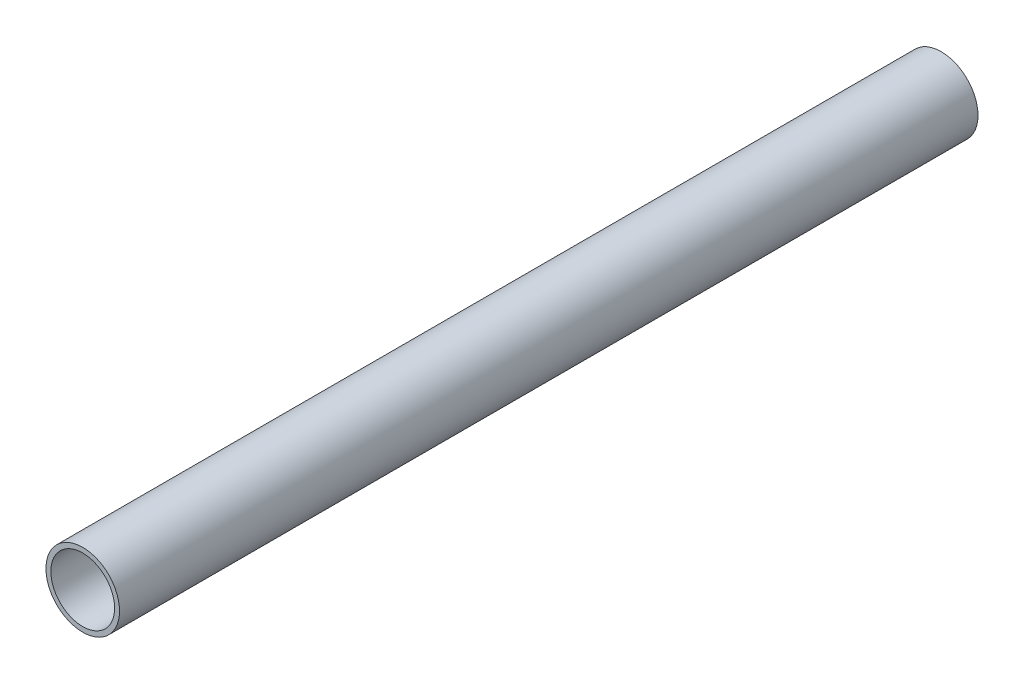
from build123d import *

# Parameters (mm, degrees)
ESQUISSE1_R             = 30
ESQUISSE1_R_2           = 25
EXTRUSION1_DEPTH        = 700
ESQUISSE2_R             = 26
ESQUISSE2_R_2           = 25
ENL_V_MAT_EXTRU_1_DEPTH = 70
ENL_V_START             = -70
ESQUISSE3_R             = 26
ESQUISSE3_R_2           = 25
ENL_V_MAT_EXTRU_2_DEPTH = 70


with BuildPart() as part:
    # Esquisse1 → Extrusion1 (new body)
    with BuildSketch(Plane.XY):
        Circle(ESQUISSE1_R)
        Circle(ESQUISSE1_R_2, mode=Mode.SUBTRACT)
    extrude(amount=EXTRUSION1_DEPTH)

    # Esquisse2 → Enl_v. mat.-Extru.1 (cut)
    with BuildSketch(Plane(origin=(0, 0, 0), x_dir=(-1, 0, 0), z_dir=(0, 0, -1))):
        Circle(ESQUISSE2_R)
        Circle(ESQUISSE2_R_2, mode=Mode.SUBTRACT)
    extrude(amount=-ENL_V_MAT_EXTRU_1_DEPTH, mode=Mode.SUBTRACT)

    # Esquisse3 → Enl_v. mat.-Extru.2 (cut)
    with BuildSketch(Plane.XY.offset(700).offset(ENL_V_START)):
        with Locations(Location((0, 0, 0), (0, 0, 180))):
            Circle(ESQUISSE3_R)
        with Locations(Location((0, 0, 0), (0, 0, 180))):
            Circle(ESQUISSE3_R_2, mode=Mode.SUBTRACT)
    extrude(amount=ENL_V_MAT_EXTRU_2_DEPTH, mode=Mode.SUBTRACT)


solid = part.part
